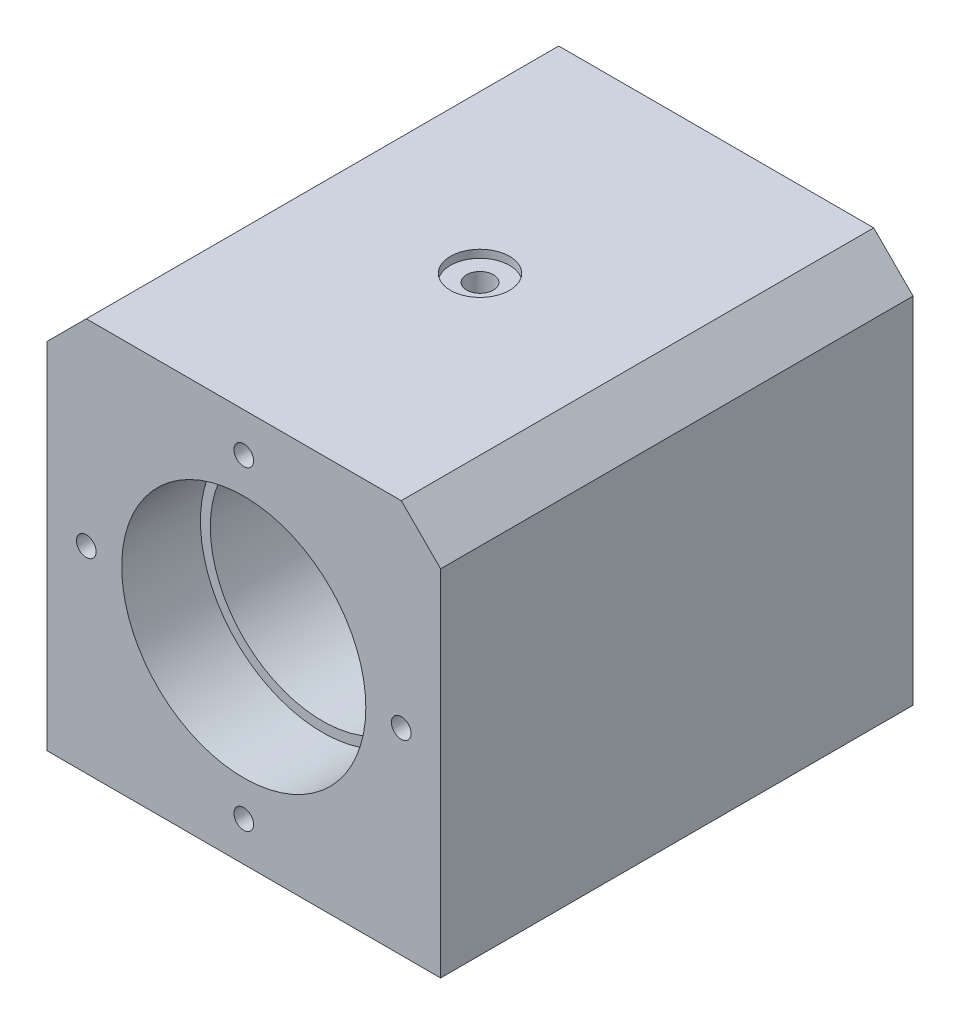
ISO-10303-21;
HEADER;
FILE_DESCRIPTION(('STEP AP214'),'2;1');
FILE_NAME('part.step','',(''),(''),'','','');
FILE_SCHEMA(('AUTOMOTIVE_DESIGN { 1 0 10303 214 1 1 1 1 }'));
ENDSEC;
DATA;
#1=APPLICATION_CONTEXT('core data for automotive mechanical design processes');
#2=APPLICATION_PROTOCOL_DEFINITION('international standard','automotive_design',2000,#1);
#3=PRODUCT_CONTEXT('',#1,'mechanical');
#4=PRODUCT('Part','Part','',(#3));
#5=PRODUCT_RELATED_PRODUCT_CATEGORY('part','',(#4));
#6=PRODUCT_DEFINITION_FORMATION('','',#4);
#7=PRODUCT_DEFINITION_CONTEXT('part definition',#1,'design');
#8=PRODUCT_DEFINITION('design','',#6,#7);
#9=PRODUCT_DEFINITION_SHAPE('','',#8);
#10=(LENGTH_UNIT() NAMED_UNIT(*) SI_UNIT(.MILLI.,.METRE.));
#11=(NAMED_UNIT(*) PLANE_ANGLE_UNIT() SI_UNIT($,.RADIAN.));
#12=(NAMED_UNIT(*) SI_UNIT($,.STERADIAN.) SOLID_ANGLE_UNIT());
#13=UNCERTAINTY_MEASURE_WITH_UNIT(LENGTH_MEASURE(1.E-05),#10,'distance_accuracy_value','');
#14=(GEOMETRIC_REPRESENTATION_CONTEXT(3) GLOBAL_UNCERTAINTY_ASSIGNED_CONTEXT((#13)) GLOBAL_UNIT_ASSIGNED_CONTEXT((#10,
#11,#12)) REPRESENTATION_CONTEXT('',''));
#15=CARTESIAN_POINT('',(0.,0.,0.));
#16=DIRECTION('',(0.,0.,1.));
#17=DIRECTION('',(1.,0.,0.));
#18=AXIS2_PLACEMENT_3D('',#15,#16,#17);
#19=CARTESIAN_POINT('',(0.,0.,-60.));
#20=DIRECTION('',(0.,0.,1.));
#21=DIRECTION('',(1.,0.,0.));
#22=AXIS2_PLACEMENT_3D('',#19,#20,#21);
#23=PLANE('',#22);
#24=CARTESIAN_POINT('',(0.,40.,-60.));
#25=DIRECTION('',(0.,0.,-1.));
#26=DIRECTION('',(-1.,0.,0.));
#27=AXIS2_PLACEMENT_3D('',#24,#25,#26);
#28=CIRCLE('',#27,2.5);
#29=CARTESIAN_POINT('',(-2.5,40.,-60.));
#30=VERTEX_POINT('',#29);
#31=EDGE_CURVE('E167',#30,#30,#28,.T.);
#32=ORIENTED_EDGE('',*,*,#31,.F.);
#33=EDGE_LOOP('',(#32));
#34=FACE_BOUND('',#33,.T.);
#35=CARTESIAN_POINT('',(40.,0.,-60.));
#36=DIRECTION('',(0.,0.,-1.));
#37=DIRECTION('',(-1.,0.,0.));
#38=AXIS2_PLACEMENT_3D('',#35,#36,#37);
#39=CIRCLE('',#38,2.5);
#40=CARTESIAN_POINT('',(37.5,0.,-60.));
#41=VERTEX_POINT('',#40);
#42=EDGE_CURVE('E173',#41,#41,#39,.T.);
#43=ORIENTED_EDGE('',*,*,#42,.F.);
#44=EDGE_LOOP('',(#43));
#45=FACE_BOUND('',#44,.T.);
#46=CARTESIAN_POINT('',(0.,-40.,-60.));
#47=DIRECTION('',(0.,0.,-1.));
#48=DIRECTION('',(-1.,0.,0.));
#49=AXIS2_PLACEMENT_3D('',#46,#47,#48);
#50=CIRCLE('',#49,2.5);
#51=CARTESIAN_POINT('',(-2.49999999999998,-40.,-60.));
#52=VERTEX_POINT('',#51);
#53=EDGE_CURVE('E179',#52,#52,#50,.T.);
#54=ORIENTED_EDGE('',*,*,#53,.F.);
#55=EDGE_LOOP('',(#54));
#56=FACE_BOUND('',#55,.T.);
#57=CARTESIAN_POINT('',(-40.,0.,-60.));
#58=DIRECTION('',(0.,0.,-1.));
#59=DIRECTION('',(-1.,0.,0.));
#60=AXIS2_PLACEMENT_3D('',#57,#58,#59);
#61=CIRCLE('',#60,2.5);
#62=CARTESIAN_POINT('',(-42.5,0.,-60.));
#63=VERTEX_POINT('',#62);
#64=EDGE_CURVE('E185',#63,#63,#61,.T.);
#65=ORIENTED_EDGE('',*,*,#64,.F.);
#66=EDGE_LOOP('',(#65));
#67=FACE_BOUND('',#66,.T.);
#68=DIRECTION('',(-1.,0.,0.));
#69=VECTOR('',#68,1.);
#70=CARTESIAN_POINT('',(-50.,50.,-60.));
#71=LINE('',#70,#69);
#72=CARTESIAN_POINT('',(40.,50.,-60.));
#73=VERTEX_POINT('',#72);
#74=CARTESIAN_POINT('',(-40.,50.,-60.));
#75=VERTEX_POINT('',#74);
#76=EDGE_CURVE('E252',#73,#75,#71,.T.);
#77=ORIENTED_EDGE('',*,*,#76,.F.);
#78=DIRECTION('',(-0.707106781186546,0.707106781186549,0.));
#79=VECTOR('',#78,1.);
#80=CARTESIAN_POINT('',(40.,50.,-60.));
#81=LINE('',#80,#79);
#82=CARTESIAN_POINT('',(50.,40.,-60.));
#83=VERTEX_POINT('',#82);
#84=EDGE_CURVE('E270',#73,#83,#81,.F.);
#85=ORIENTED_EDGE('',*,*,#84,.T.);
#86=DIRECTION('',(0.,1.,0.));
#87=VECTOR('',#86,1.);
#88=CARTESIAN_POINT('',(50.,50.,-60.));
#89=LINE('',#88,#87);
#90=CARTESIAN_POINT('',(50.,-50.,-60.));
#91=VERTEX_POINT('',#90);
#92=EDGE_CURVE('E238',#91,#83,#89,.T.);
#93=ORIENTED_EDGE('',*,*,#92,.F.);
#94=DIRECTION('',(1.,0.,0.));
#95=VECTOR('',#94,1.);
#96=CARTESIAN_POINT('',(-50.,-50.,-60.));
#97=LINE('',#96,#95);
#98=CARTESIAN_POINT('',(-50.,-50.,-60.));
#99=VERTEX_POINT('',#98);
#100=EDGE_CURVE('E244',#99,#91,#97,.T.);
#101=ORIENTED_EDGE('',*,*,#100,.F.);
#102=DIRECTION('',(0.,-1.,0.));
#103=VECTOR('',#102,1.);
#104=CARTESIAN_POINT('',(-50.,50.,-60.));
#105=LINE('',#104,#103);
#106=CARTESIAN_POINT('',(-50.,40.,-60.));
#107=VERTEX_POINT('',#106);
#108=EDGE_CURVE('E255',#107,#99,#105,.T.);
#109=ORIENTED_EDGE('',*,*,#108,.F.);
#110=DIRECTION('',(-0.70710678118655,-0.707106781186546,0.));
#111=VECTOR('',#110,1.);
#112=CARTESIAN_POINT('',(-50.,40.,-60.));
#113=LINE('',#112,#111);
#114=EDGE_CURVE('E268',#107,#75,#113,.F.);
#115=ORIENTED_EDGE('',*,*,#114,.T.);
#116=EDGE_LOOP('',(#77,#85,#93,#101,#109,#115));
#117=FACE_BOUND('',#116,.T.);
#118=CARTESIAN_POINT('',(0.,0.,-60.));
#119=DIRECTION('',(0.,0.,1.));
#120=DIRECTION('',(1.,0.,0.));
#121=AXIS2_PLACEMENT_3D('',#118,#119,#120);
#122=CIRCLE('',#121,31.);
#123=CARTESIAN_POINT('',(31.,0.,-60.));
#124=VERTEX_POINT('',#123);
#125=EDGE_CURVE('E221',#124,#124,#122,.T.);
#126=ORIENTED_EDGE('',*,*,#125,.T.);
#127=EDGE_LOOP('',(#126));
#128=FACE_BOUND('',#127,.T.);
#129=ADVANCED_FACE('F38',(#34,#45,#56,#67,#117,#128),#23,.F.);
#130=CARTESIAN_POINT('',(50.,50.,60.));
#131=DIRECTION('',(-1.,0.,0.));
#132=DIRECTION('',(0.,0.,1.));
#133=AXIS2_PLACEMENT_3D('',#130,#131,#132);
#134=PLANE('',#133);
#135=ORIENTED_EDGE('',*,*,#92,.T.);
#136=DIRECTION('',(0.,0.,1.));
#137=VECTOR('',#136,1.);
#138=CARTESIAN_POINT('',(50.,40.,60.));
#139=LINE('',#138,#137);
#140=CARTESIAN_POINT('',(50.,40.,60.));
#141=VERTEX_POINT('',#140);
#142=EDGE_CURVE('E67',#83,#141,#139,.T.);
#143=ORIENTED_EDGE('',*,*,#142,.T.);
#144=DIRECTION('',(0.,1.,0.));
#145=VECTOR('',#144,1.);
#146=CARTESIAN_POINT('',(50.,50.,60.));
#147=LINE('',#146,#145);
#148=CARTESIAN_POINT('',(50.,-50.,60.));
#149=VERTEX_POINT('',#148);
#150=EDGE_CURVE('E241',#149,#141,#147,.T.);
#151=ORIENTED_EDGE('',*,*,#150,.F.);
#152=DIRECTION('',(0.,0.,-1.));
#153=VECTOR('',#152,1.);
#154=CARTESIAN_POINT('',(50.,-50.,60.));
#155=LINE('',#154,#153);
#156=EDGE_CURVE('E250',#149,#91,#155,.T.);
#157=ORIENTED_EDGE('',*,*,#156,.T.);
#158=EDGE_LOOP('',(#135,#143,#151,#157));
#159=FACE_BOUND('',#158,.T.);
#160=ADVANCED_FACE('F297',(#159),#134,.F.);
#161=CARTESIAN_POINT('',(-50.,50.,60.));
#162=DIRECTION('',(0.,-1.,0.));
#163=DIRECTION('',(0.,0.,-1.));
#164=AXIS2_PLACEMENT_3D('',#161,#162,#163);
#165=PLANE('',#164);
#166=CARTESIAN_POINT('',(0.,50.,0.));
#167=DIRECTION('',(0.,1.,0.));
#168=DIRECTION('',(0.,0.,1.));
#169=AXIS2_PLACEMENT_3D('',#166,#167,#168);
#170=CIRCLE('',#169,7.5);
#171=CARTESIAN_POINT('',(0.,50.,7.5));
#172=VERTEX_POINT('',#171);
#173=EDGE_CURVE('E232',#172,#172,#170,.T.);
#174=ORIENTED_EDGE('',*,*,#173,.F.);
#175=EDGE_LOOP('',(#174));
#176=FACE_BOUND('',#175,.T.);
#177=DIRECTION('',(-1.,0.,0.));
#178=VECTOR('',#177,1.);
#179=CARTESIAN_POINT('',(-50.,50.,60.));
#180=LINE('',#179,#178);
#181=CARTESIAN_POINT('',(40.,50.,60.));
#182=VERTEX_POINT('',#181);
#183=CARTESIAN_POINT('',(-40.,50.,60.));
#184=VERTEX_POINT('',#183);
#185=EDGE_CURVE('E243',#182,#184,#180,.T.);
#186=ORIENTED_EDGE('',*,*,#185,.F.);
#187=DIRECTION('',(0.,0.,-1.));
#188=VECTOR('',#187,1.);
#189=CARTESIAN_POINT('',(40.,50.,60.));
#190=LINE('',#189,#188);
#191=EDGE_CURVE('E265',#182,#73,#190,.T.);
#192=ORIENTED_EDGE('',*,*,#191,.T.);
#193=ORIENTED_EDGE('',*,*,#76,.T.);
#194=DIRECTION('',(0.,0.,1.));
#195=VECTOR('',#194,1.);
#196=CARTESIAN_POINT('',(-40.,50.,60.));
#197=LINE('',#196,#195);
#198=EDGE_CURVE('E263',#75,#184,#197,.T.);
#199=ORIENTED_EDGE('',*,*,#198,.T.);
#200=EDGE_LOOP('',(#186,#192,#193,#199));
#201=FACE_BOUND('',#200,.T.);
#202=ADVANCED_FACE('F303',(#176,#201),#165,.F.);
#203=CARTESIAN_POINT('',(-50.,50.,60.));
#204=DIRECTION('',(1.,0.,0.));
#205=DIRECTION('',(0.,1.,0.));
#206=AXIS2_PLACEMENT_3D('',#203,#204,#205);
#207=PLANE('',#206);
#208=DIRECTION('',(0.,-1.,0.));
#209=VECTOR('',#208,1.);
#210=CARTESIAN_POINT('',(-50.,50.,60.));
#211=LINE('',#210,#209);
#212=CARTESIAN_POINT('',(-50.,40.,60.));
#213=VERTEX_POINT('',#212);
#214=CARTESIAN_POINT('',(-50.,-50.,60.));
#215=VERTEX_POINT('',#214);
#216=EDGE_CURVE('E246',#213,#215,#211,.T.);
#217=ORIENTED_EDGE('',*,*,#216,.F.);
#218=DIRECTION('',(0.,0.,-1.));
#219=VECTOR('',#218,1.);
#220=CARTESIAN_POINT('',(-50.,40.,60.));
#221=LINE('',#220,#219);
#222=EDGE_CURVE('E11',#213,#107,#221,.T.);
#223=ORIENTED_EDGE('',*,*,#222,.T.);
#224=ORIENTED_EDGE('',*,*,#108,.T.);
#225=DIRECTION('',(0.,0.,-1.));
#226=VECTOR('',#225,1.);
#227=CARTESIAN_POINT('',(-50.,-50.,60.));
#228=LINE('',#227,#226);
#229=EDGE_CURVE('E260',#215,#99,#228,.T.);
#230=ORIENTED_EDGE('',*,*,#229,.F.);
#231=EDGE_LOOP('',(#217,#223,#224,#230));
#232=FACE_BOUND('',#231,.T.);
#233=ADVANCED_FACE('F314',(#232),#207,.F.);
#234=CARTESIAN_POINT('',(-50.,-50.,60.));
#235=DIRECTION('',(0.,1.,0.));
#236=DIRECTION('',(0.,0.,1.));
#237=AXIS2_PLACEMENT_3D('',#234,#235,#236);
#238=PLANE('',#237);
#239=CARTESIAN_POINT('',(-18.,-50.,40.));
#240=DIRECTION('',(0.,-1.,0.));
#241=DIRECTION('',(0.,0.,-1.));
#242=AXIS2_PLACEMENT_3D('',#239,#240,#241);
#243=CIRCLE('',#242,3.4);
#244=CARTESIAN_POINT('',(-18.,-50.,36.6));
#245=VERTEX_POINT('',#244);
#246=EDGE_CURVE('E145',#245,#245,#243,.T.);
#247=ORIENTED_EDGE('',*,*,#246,.F.);
#248=EDGE_LOOP('',(#247));
#249=FACE_BOUND('',#248,.T.);
#250=CARTESIAN_POINT('',(18.,-50.,40.));
#251=DIRECTION('',(0.,-1.,0.));
#252=DIRECTION('',(0.,0.,-1.));
#253=AXIS2_PLACEMENT_3D('',#250,#251,#252);
#254=CIRCLE('',#253,3.4);
#255=CARTESIAN_POINT('',(18.,-50.,36.6));
#256=VERTEX_POINT('',#255);
#257=EDGE_CURVE('E144',#256,#256,#254,.T.);
#258=ORIENTED_EDGE('',*,*,#257,.F.);
#259=EDGE_LOOP('',(#258));
#260=FACE_BOUND('',#259,.T.);
#261=CARTESIAN_POINT('',(-30.,-50.,40.));
#262=DIRECTION('',(0.,-1.,0.));
#263=DIRECTION('',(0.,0.,-1.));
#264=AXIS2_PLACEMENT_3D('',#261,#262,#263);
#265=CIRCLE('',#264,2.99999999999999);
#266=CARTESIAN_POINT('',(-30.,-50.,37.));
#267=VERTEX_POINT('',#266);
#268=EDGE_CURVE('E155',#267,#267,#265,.T.);
#269=ORIENTED_EDGE('',*,*,#268,.F.);
#270=EDGE_LOOP('',(#269));
#271=FACE_BOUND('',#270,.T.);
#272=CARTESIAN_POINT('',(30.,-50.,40.));
#273=DIRECTION('',(0.,-1.,0.));
#274=DIRECTION('',(0.,0.,-1.));
#275=AXIS2_PLACEMENT_3D('',#272,#273,#274);
#276=CIRCLE('',#275,2.99999999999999);
#277=CARTESIAN_POINT('',(30.,-50.,37.));
#278=VERTEX_POINT('',#277);
#279=EDGE_CURVE('E161',#278,#278,#276,.T.);
#280=ORIENTED_EDGE('',*,*,#279,.F.);
#281=EDGE_LOOP('',(#280));
#282=FACE_BOUND('',#281,.T.);
#283=ORIENTED_EDGE('',*,*,#100,.T.);
#284=ORIENTED_EDGE('',*,*,#156,.F.);
#285=DIRECTION('',(1.,0.,0.));
#286=VECTOR('',#285,1.);
#287=CARTESIAN_POINT('',(-50.,-50.,60.));
#288=LINE('',#287,#286);
#289=EDGE_CURVE('E248',#215,#149,#288,.T.);
#290=ORIENTED_EDGE('',*,*,#289,.F.);
#291=ORIENTED_EDGE('',*,*,#229,.T.);
#292=EDGE_LOOP('',(#283,#284,#290,#291));
#293=FACE_BOUND('',#292,.T.);
#294=ADVANCED_FACE('F311',(#249,#260,#271,#282,#293),#238,.F.);
#295=CARTESIAN_POINT('',(0.,0.,60.));
#296=DIRECTION('',(0.,0.,1.));
#297=DIRECTION('',(1.,0.,0.));
#298=AXIS2_PLACEMENT_3D('',#295,#296,#297);
#299=PLANE('',#298);
#300=CARTESIAN_POINT('',(0.,40.,60.));
#301=DIRECTION('',(0.,0.,1.));
#302=DIRECTION('',(1.,0.,0.));
#303=AXIS2_PLACEMENT_3D('',#300,#301,#302);
#304=CIRCLE('',#303,2.5);
#305=CARTESIAN_POINT('',(2.5,40.,60.));
#306=VERTEX_POINT('',#305);
#307=EDGE_CURVE('E191',#306,#306,#304,.T.);
#308=ORIENTED_EDGE('',*,*,#307,.F.);
#309=EDGE_LOOP('',(#308));
#310=FACE_BOUND('',#309,.T.);
#311=CARTESIAN_POINT('',(40.,0.,60.));
#312=DIRECTION('',(0.,0.,1.));
#313=DIRECTION('',(1.,0.,0.));
#314=AXIS2_PLACEMENT_3D('',#311,#312,#313);
#315=CIRCLE('',#314,2.5);
#316=CARTESIAN_POINT('',(42.5,0.,60.));
#317=VERTEX_POINT('',#316);
#318=EDGE_CURVE('E197',#317,#317,#315,.T.);
#319=ORIENTED_EDGE('',*,*,#318,.F.);
#320=EDGE_LOOP('',(#319));
#321=FACE_BOUND('',#320,.T.);
#322=CARTESIAN_POINT('',(0.,-40.,60.));
#323=DIRECTION('',(0.,0.,1.));
#324=DIRECTION('',(1.,0.,0.));
#325=AXIS2_PLACEMENT_3D('',#322,#323,#324);
#326=CIRCLE('',#325,2.5);
#327=CARTESIAN_POINT('',(2.50000000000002,-40.,60.));
#328=VERTEX_POINT('',#327);
#329=EDGE_CURVE('E203',#328,#328,#326,.T.);
#330=ORIENTED_EDGE('',*,*,#329,.F.);
#331=EDGE_LOOP('',(#330));
#332=FACE_BOUND('',#331,.T.);
#333=CARTESIAN_POINT('',(-40.,0.,60.));
#334=DIRECTION('',(0.,0.,1.));
#335=DIRECTION('',(1.,0.,0.));
#336=AXIS2_PLACEMENT_3D('',#333,#334,#335);
#337=CIRCLE('',#336,2.5);
#338=CARTESIAN_POINT('',(-37.5,0.,60.));
#339=VERTEX_POINT('',#338);
#340=EDGE_CURVE('E209',#339,#339,#337,.T.);
#341=ORIENTED_EDGE('',*,*,#340,.F.);
#342=EDGE_LOOP('',(#341));
#343=FACE_BOUND('',#342,.T.);
#344=CARTESIAN_POINT('',(0.,0.,60.));
#345=DIRECTION('',(0.,0.,1.));
#346=DIRECTION('',(1.,0.,0.));
#347=AXIS2_PLACEMENT_3D('',#344,#345,#346);
#348=CIRCLE('',#347,31.);
#349=CARTESIAN_POINT('',(31.,0.,60.));
#350=VERTEX_POINT('',#349);
#351=EDGE_CURVE('E226',#350,#350,#348,.T.);
#352=ORIENTED_EDGE('',*,*,#351,.F.);
#353=EDGE_LOOP('',(#352));
#354=FACE_BOUND('',#353,.T.);
#355=ORIENTED_EDGE('',*,*,#150,.T.);
#356=DIRECTION('',(0.707106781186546,-0.707106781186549,0.));
#357=VECTOR('',#356,1.);
#358=CARTESIAN_POINT('',(45.0000000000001,44.9999999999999,60.));
#359=LINE('',#358,#357);
#360=EDGE_CURVE('E51',#141,#182,#359,.F.);
#361=ORIENTED_EDGE('',*,*,#360,.T.);
#362=ORIENTED_EDGE('',*,*,#185,.T.);
#363=DIRECTION('',(0.70710678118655,0.707106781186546,0.));
#364=VECTOR('',#363,1.);
#365=CARTESIAN_POINT('',(-44.9999999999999,45.0000000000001,60.));
#366=LINE('',#365,#364);
#367=EDGE_CURVE('E59',#184,#213,#366,.F.);
#368=ORIENTED_EDGE('',*,*,#367,.T.);
#369=ORIENTED_EDGE('',*,*,#216,.T.);
#370=ORIENTED_EDGE('',*,*,#289,.T.);
#371=EDGE_LOOP('',(#355,#361,#362,#368,#369,#370));
#372=FACE_BOUND('',#371,.T.);
#373=ADVANCED_FACE('F309',(#310,#321,#332,#343,#354,#372),#299,.T.);
#374=CARTESIAN_POINT('',(40.,50.,60.));
#375=DIRECTION('',(-0.707106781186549,-0.707106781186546,0.));
#376=DIRECTION('',(0.,0.,-1.));
#377=AXIS2_PLACEMENT_3D('',#374,#375,#376);
#378=PLANE('',#377);
#379=ORIENTED_EDGE('',*,*,#360,.F.);
#380=ORIENTED_EDGE('',*,*,#142,.F.);
#381=ORIENTED_EDGE('',*,*,#84,.F.);
#382=ORIENTED_EDGE('',*,*,#191,.F.);
#383=EDGE_LOOP('',(#379,#380,#381,#382));
#384=FACE_BOUND('',#383,.T.);
#385=ADVANCED_FACE('F321',(#384),#378,.F.);
#386=CARTESIAN_POINT('',(-50.,40.,60.));
#387=DIRECTION('',(0.707106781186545,-0.707106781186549,0.));
#388=DIRECTION('',(0.,0.,-1.));
#389=AXIS2_PLACEMENT_3D('',#386,#387,#388);
#390=PLANE('',#389);
#391=ORIENTED_EDGE('',*,*,#367,.F.);
#392=ORIENTED_EDGE('',*,*,#198,.F.);
#393=ORIENTED_EDGE('',*,*,#114,.F.);
#394=ORIENTED_EDGE('',*,*,#222,.F.);
#395=EDGE_LOOP('',(#391,#392,#393,#394));
#396=FACE_BOUND('',#395,.T.);
#397=ADVANCED_FACE('F40',(#396),#390,.F.);
#398=CARTESIAN_POINT('',(0.,48.,0.));
#399=DIRECTION('',(0.,1.,0.));
#400=DIRECTION('',(0.,0.,1.));
#401=AXIS2_PLACEMENT_3D('',#398,#399,#400);
#402=CYLINDRICAL_SURFACE('',#401,7.5);
#403=CARTESIAN_POINT('',(0.,48.,0.));
#404=DIRECTION('',(0.,1.,0.));
#405=DIRECTION('',(0.,0.,1.));
#406=AXIS2_PLACEMENT_3D('',#403,#404,#405);
#407=CIRCLE('',#406,7.5);
#408=CARTESIAN_POINT('',(0.,48.,7.5));
#409=VERTEX_POINT('',#408);
#410=EDGE_CURVE('E235',#409,#409,#407,.T.);
#411=ORIENTED_EDGE('',*,*,#410,.F.);
#412=EDGE_LOOP('',(#411));
#413=FACE_BOUND('',#412,.T.);
#414=ORIENTED_EDGE('',*,*,#173,.T.);
#415=EDGE_LOOP('',(#414));
#416=FACE_BOUND('',#415,.T.);
#417=ADVANCED_FACE('F328',(#413,#416),#402,.F.);
#418=CARTESIAN_POINT('',(0.,48.,0.));
#419=DIRECTION('',(0.,1.,0.));
#420=DIRECTION('',(0.,0.,1.));
#421=AXIS2_PLACEMENT_3D('',#418,#419,#420);
#422=PLANE('',#421);
#423=CARTESIAN_POINT('',(0.,48.,0.));
#424=DIRECTION('',(0.,1.,0.));
#425=DIRECTION('',(0.,0.,1.));
#426=AXIS2_PLACEMENT_3D('',#423,#424,#425);
#427=CIRCLE('',#426,3.39999999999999);
#428=CARTESIAN_POINT('',(0.,48.,3.39999999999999));
#429=VERTEX_POINT('',#428);
#430=EDGE_CURVE('E215',#429,#429,#427,.T.);
#431=ORIENTED_EDGE('',*,*,#430,.F.);
#432=EDGE_LOOP('',(#431));
#433=FACE_BOUND('',#432,.T.);
#434=ORIENTED_EDGE('',*,*,#410,.T.);
#435=EDGE_LOOP('',(#434));
#436=FACE_BOUND('',#435,.T.);
#437=ADVANCED_FACE('F366',(#433,#436),#422,.T.);
#438=CARTESIAN_POINT('',(0.,0.,40.));
#439=DIRECTION('',(0.,0.,1.));
#440=DIRECTION('',(1.,0.,0.));
#441=AXIS2_PLACEMENT_3D('',#438,#439,#440);
#442=CYLINDRICAL_SURFACE('',#441,31.);
#443=CARTESIAN_POINT('',(0.,0.,40.));
#444=DIRECTION('',(0.,0.,1.));
#445=DIRECTION('',(1.,0.,0.));
#446=AXIS2_PLACEMENT_3D('',#443,#444,#445);
#447=CIRCLE('',#446,31.);
#448=CARTESIAN_POINT('',(31.,0.,40.));
#449=VERTEX_POINT('',#448);
#450=EDGE_CURVE('E229',#449,#449,#447,.T.);
#451=ORIENTED_EDGE('',*,*,#450,.F.);
#452=EDGE_LOOP('',(#451));
#453=FACE_BOUND('',#452,.T.);
#454=ORIENTED_EDGE('',*,*,#351,.T.);
#455=EDGE_LOOP('',(#454));
#456=FACE_BOUND('',#455,.T.);
#457=ADVANCED_FACE('F360',(#453,#456),#442,.F.);
#458=CARTESIAN_POINT('',(0.,0.,40.));
#459=DIRECTION('',(0.,0.,1.));
#460=DIRECTION('',(1.,0.,0.));
#461=AXIS2_PLACEMENT_3D('',#458,#459,#460);
#462=PLANE('',#461);
#463=CARTESIAN_POINT('',(0.,0.,40.));
#464=DIRECTION('',(0.,0.,1.));
#465=DIRECTION('',(1.,0.,0.));
#466=AXIS2_PLACEMENT_3D('',#463,#464,#465);
#467=CIRCLE('',#466,28.5);
#468=CARTESIAN_POINT('',(28.5,0.,40.));
#469=VERTEX_POINT('',#468);
#470=EDGE_CURVE('E218',#469,#469,#467,.T.);
#471=ORIENTED_EDGE('',*,*,#470,.F.);
#472=EDGE_LOOP('',(#471));
#473=FACE_BOUND('',#472,.T.);
#474=ORIENTED_EDGE('',*,*,#450,.T.);
#475=EDGE_LOOP('',(#474));
#476=FACE_BOUND('',#475,.T.);
#477=ADVANCED_FACE('F351',(#473,#476),#462,.T.);
#478=CARTESIAN_POINT('',(0.,0.,-40.));
#479=DIRECTION('',(0.,0.,-1.));
#480=DIRECTION('',(-1.,0.,0.));
#481=AXIS2_PLACEMENT_3D('',#478,#479,#480);
#482=CYLINDRICAL_SURFACE('',#481,31.);
#483=CARTESIAN_POINT('',(0.,0.,-40.));
#484=DIRECTION('',(0.,0.,1.));
#485=DIRECTION('',(1.,0.,0.));
#486=AXIS2_PLACEMENT_3D('',#483,#484,#485);
#487=CIRCLE('',#486,31.);
#488=CARTESIAN_POINT('',(31.,0.,-40.));
#489=VERTEX_POINT('',#488);
#490=EDGE_CURVE('E223',#489,#489,#487,.T.);
#491=ORIENTED_EDGE('',*,*,#490,.T.);
#492=EDGE_LOOP('',(#491));
#493=FACE_BOUND('',#492,.T.);
#494=ORIENTED_EDGE('',*,*,#125,.F.);
#495=EDGE_LOOP('',(#494));
#496=FACE_BOUND('',#495,.T.);
#497=ADVANCED_FACE('F349',(#493,#496),#482,.F.);
#498=CARTESIAN_POINT('',(0.,0.,-40.));
#499=DIRECTION('',(0.,0.,-1.));
#500=DIRECTION('',(1.,0.,0.));
#501=AXIS2_PLACEMENT_3D('',#498,#499,#500);
#502=PLANE('',#501);
#503=CARTESIAN_POINT('',(0.,0.,-40.));
#504=DIRECTION('',(0.,0.,-1.));
#505=DIRECTION('',(-1.,0.,0.));
#506=AXIS2_PLACEMENT_3D('',#503,#504,#505);
#507=CIRCLE('',#506,28.5);
#508=CARTESIAN_POINT('',(-28.5,0.,-40.));
#509=VERTEX_POINT('',#508);
#510=EDGE_CURVE('E222',#509,#509,#507,.T.);
#511=ORIENTED_EDGE('',*,*,#510,.F.);
#512=EDGE_LOOP('',(#511));
#513=FACE_BOUND('',#512,.T.);
#514=ORIENTED_EDGE('',*,*,#490,.F.);
#515=EDGE_LOOP('',(#514));
#516=FACE_BOUND('',#515,.T.);
#517=ADVANCED_FACE('F294',(#513,#516),#502,.T.);
#518=CARTESIAN_POINT('',(0.,0.,-60.));
#519=DIRECTION('',(0.,0.,1.));
#520=DIRECTION('',(1.,0.,0.));
#521=AXIS2_PLACEMENT_3D('',#518,#519,#520);
#522=CYLINDRICAL_SURFACE('',#521,28.5);
#523=CARTESIAN_POINT('',(0.,28.5,3.39999999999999));
#524=CARTESIAN_POINT('',(0.190254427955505,28.4999974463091,3.39999187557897));
#525=CARTESIAN_POINT('',(0.380629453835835,28.4980747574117,3.38397702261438));
#526=CARTESIAN_POINT('',(0.756086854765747,28.4905896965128,3.32034070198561));
#527=CARTESIAN_POINT('',(0.941163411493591,28.4850234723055,3.27268578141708));
#528=CARTESIAN_POINT('',(1.30053362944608,28.47087871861,3.14718917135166));
#529=CARTESIAN_POINT('',(1.47483427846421,28.4623021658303,3.06936728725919));
#530=CARTESIAN_POINT('',(1.80786668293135,28.4430919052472,2.88578799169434));
#531=CARTESIAN_POINT('',(1.96660120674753,28.4324585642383,2.78003555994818));
#532=CARTESIAN_POINT('',(2.26482899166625,28.4102630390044,2.54302739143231));
#533=CARTESIAN_POINT('',(2.404232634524,28.3986968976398,2.41165924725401));
#534=CARTESIAN_POINT('',(2.65907002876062,28.3759714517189,2.12738978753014));
#535=CARTESIAN_POINT('',(2.77450258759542,28.3648121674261,1.97448740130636));
#536=CARTESIAN_POINT('',(2.97845129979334,28.3441247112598,1.65091214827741));
#537=CARTESIAN_POINT('',(3.06688413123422,28.3346016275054,1.48018641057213));
#538=CARTESIAN_POINT('',(3.21379102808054,28.3183163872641,1.12617495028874));
#539=CARTESIAN_POINT('',(3.27226613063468,28.3115541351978,0.942889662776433));
#540=CARTESIAN_POINT('',(3.3573268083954,28.301593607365,0.569888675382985));
#541=CARTESIAN_POINT('',(3.38406314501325,28.2983784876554,0.380207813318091));
#542=CARTESIAN_POINT('',(3.40535373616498,28.2958245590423,-0.00097383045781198));
#543=CARTESIAN_POINT('',(3.39990917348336,28.2964856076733,-0.192474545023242));
#544=CARTESIAN_POINT('',(3.35711639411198,28.3015939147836,-0.570812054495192));
#545=CARTESIAN_POINT('',(3.31993388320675,28.3060215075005,-0.757667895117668));
#546=CARTESIAN_POINT('',(3.21497904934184,28.3181333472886,-1.12246852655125));
#547=CARTESIAN_POINT('',(3.14720615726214,28.3258176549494,-1.30041315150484));
#548=CARTESIAN_POINT('',(2.98281509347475,28.3435994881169,-1.64285708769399));
#549=CARTESIAN_POINT('',(2.88612454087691,28.3537030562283,-1.80732132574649));
#550=CARTESIAN_POINT('',(2.66669467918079,28.375180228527,-2.11775175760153));
#551=CARTESIAN_POINT('',(2.54395428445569,28.386553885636,-2.26371718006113));
#552=CARTESIAN_POINT('',(2.27498876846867,28.4093772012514,-2.53396864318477));
#553=CARTESIAN_POINT('',(2.12862074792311,28.4208268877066,-2.65811250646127));
#554=CARTESIAN_POINT('',(1.81704787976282,28.4424450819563,-2.88009109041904));
#555=CARTESIAN_POINT('',(1.65184299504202,28.452613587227,-2.97792575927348));
#556=CARTESIAN_POINT('',(1.30717906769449,28.4705292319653,-3.14450745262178));
#557=CARTESIAN_POINT('',(1.12771588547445,28.4782756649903,-3.21324599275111));
#558=CARTESIAN_POINT('',(0.75968173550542,28.4904677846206,-3.31957347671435));
#559=CARTESIAN_POINT('',(0.571111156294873,28.4949136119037,-3.35716374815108));
#560=CARTESIAN_POINT('',(0.191444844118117,28.4999853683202,-3.39994433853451));
#561=CARTESIAN_POINT('',(0.000371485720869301,28.500634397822,-3.4053305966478));
#562=CARTESIAN_POINT('',(-0.379955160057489,28.4981016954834,-3.38406674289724));
#563=CARTESIAN_POINT('',(-0.569208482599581,28.4949200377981,-3.35741725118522));
#564=CARTESIAN_POINT('',(-0.939947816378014,28.4850979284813,-3.27300110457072));
#565=CARTESIAN_POINT('',(-1.12145530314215,28.4784678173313,-3.21532746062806));
#566=CARTESIAN_POINT('',(-1.47222143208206,28.4624914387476,-3.07059657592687));
#567=CARTESIAN_POINT('',(-1.6414796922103,28.4531450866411,-2.98353841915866));
#568=CARTESIAN_POINT('',(-1.96382051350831,28.4327214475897,-2.78203277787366));
#569=CARTESIAN_POINT('',(-2.1168230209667,28.4216362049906,-2.66745805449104));
#570=CARTESIAN_POINT('',(-2.40149570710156,28.3990008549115,-2.4143522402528));
#571=CARTESIAN_POINT('',(-2.53316511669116,28.3874507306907,-2.27582028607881));
#572=CARTESIAN_POINT('',(-2.77212552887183,28.3651165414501,-1.97787130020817));
#573=CARTESIAN_POINT('',(-2.87928696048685,28.3543367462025,-1.81834998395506));
#574=CARTESIAN_POINT('',(-3.06529546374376,28.3348327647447,-1.48345858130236));
#575=CARTESIAN_POINT('',(-3.14414305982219,28.3261085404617,-1.30808878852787));
#576=CARTESIAN_POINT('',(-3.27107414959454,28.3117320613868,-0.946903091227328));
#577=CARTESIAN_POINT('',(-3.3192316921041,28.3060724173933,-0.76111351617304));
#578=CARTESIAN_POINT('',(-3.3836545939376,28.2984443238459,-0.384013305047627));
#579=CARTESIAN_POINT('',(-3.39992129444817,28.2964757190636,-0.192702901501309));
#580=CARTESIAN_POINT('',(-3.40007764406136,28.2964568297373,0.188719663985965));
#581=CARTESIAN_POINT('',(-3.38417084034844,28.2983819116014,0.378831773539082));
#582=CARTESIAN_POINT('',(-3.32086170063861,28.3058806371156,0.753660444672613));
#583=CARTESIAN_POINT('',(-3.27345935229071,28.3114542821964,0.938377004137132));
#584=CARTESIAN_POINT('',(-3.148566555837,28.3256147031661,1.29715050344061));
#585=CARTESIAN_POINT('',(-3.071084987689,28.3342005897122,1.47121057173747));
#586=CARTESIAN_POINT('',(-2.88825330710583,28.3534196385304,1.8038905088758));
#587=CARTESIAN_POINT('',(-2.78290296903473,28.3640528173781,1.96251025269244));
#588=CARTESIAN_POINT('',(-2.54656636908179,28.3862490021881,2.26084835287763));
#589=CARTESIAN_POINT('',(-2.41542831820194,28.3978172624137,2.40044608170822));
#590=CARTESIAN_POINT('',(-2.13155296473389,28.4205333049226,2.6557344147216));
#591=CARTESIAN_POINT('',(-1.97881055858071,28.431680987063,2.77141935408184));
#592=CARTESIAN_POINT('',(-1.65545862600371,28.4523421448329,2.97593551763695));
#593=CARTESIAN_POINT('',(-1.48478884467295,28.4618498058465,3.06467200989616));
#594=CARTESIAN_POINT('',(-1.13095580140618,28.4780999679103,3.21210105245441));
#595=CARTESIAN_POINT('',(-0.947806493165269,28.4848455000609,3.27082655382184));
#596=CARTESIAN_POINT('',(-0.636405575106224,28.4931681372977,3.34236357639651));
#597=CARTESIAN_POINT('',(-0.510124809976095,28.4957177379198,3.36394655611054));
#598=CARTESIAN_POINT('',(-0.255914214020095,28.499134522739,3.3927674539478));
#599=CARTESIAN_POINT('',(-0.127984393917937,28.5000017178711,3.40000546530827));
#600=CARTESIAN_POINT('',(0.,28.5,3.39999999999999));
#601=B_SPLINE_CURVE_WITH_KNOTS('',3,(#523,#524,#525,#526,#527,#528,#529,#530,#531,#532,#533,
#534,#535,#536,#537,#538,#539,#540,#541,#542,#543,#544,#545,#546,#547,#548,#549,#550,#551,#552,
#553,#554,#555,#556,#557,#558,#559,#560,#561,#562,#563,#564,#565,#566,#567,#568,#569,#570,#571,
#572,#573,#574,#575,#576,#577,#578,#579,#580,#581,#582,#583,#584,#585,#586,#587,#588,#589,#590,
#591,#592,#593,#594,#595,#596,#597,#598,#599,#600),.UNSPECIFIED.,.T.,.F.,(4,2,2,2,2,2,2,2,2,2,2,
2,2,2,2,2,2,2,2,2,2,2,2,2,2,2,2,2,2,2,2,2,2,2,2,2,2,2,4),(0.,0.570295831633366,1.14119559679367,
1.71172118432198,2.28214512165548,2.85513094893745,3.42814527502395,4.00291047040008,
4.57765576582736,5.14965991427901,5.72164303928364,6.29065794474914,6.85968343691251,
7.43014529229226,8.00063092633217,8.57470586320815,9.14878193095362,9.72302528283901,
10.2972441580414,10.8679657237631,11.4386762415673,12.0076852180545,12.5767119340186,
13.1484223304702,13.720153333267,14.2948405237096,14.8695170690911,15.4428017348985,
16.0160622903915,16.5857074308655,17.1553527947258,17.7248301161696,18.2943120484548,
18.8672521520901,19.440327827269,20.0153953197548,20.5898300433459,20.9734712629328,
21.3571099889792),.UNSPECIFIED.);
#602=CARTESIAN_POINT('',(0.,28.5,3.39999999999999));
#603=VERTEX_POINT('',#602);
#604=EDGE_CURVE('E42',#603,#603,#601,.T.);
#605=ORIENTED_EDGE('',*,*,#604,.T.);
#606=EDGE_LOOP('',(#605));
#607=FACE_BOUND('',#606,.T.);
#608=ORIENTED_EDGE('',*,*,#470,.T.);
#609=EDGE_LOOP('',(#608));
#610=FACE_BOUND('',#609,.T.);
#611=ORIENTED_EDGE('',*,*,#510,.T.);
#612=EDGE_LOOP('',(#611));
#613=FACE_BOUND('',#612,.T.);
#614=ADVANCED_FACE('F280',(#607,#610,#613),#522,.F.);
#615=CARTESIAN_POINT('',(0.,48.,0.));
#616=DIRECTION('',(0.,1.,0.));
#617=DIRECTION('',(0.,0.,1.));
#618=AXIS2_PLACEMENT_3D('',#615,#616,#617);
#619=CYLINDRICAL_SURFACE('',#618,3.39999999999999);
#620=ORIENTED_EDGE('',*,*,#430,.T.);
#621=EDGE_LOOP('',(#620));
#622=FACE_BOUND('',#621,.T.);
#623=ORIENTED_EDGE('',*,*,#604,.F.);
#624=EDGE_LOOP('',(#623));
#625=FACE_BOUND('',#624,.T.);
#626=ADVANCED_FACE('F283',(#622,#625),#619,.F.);
#627=CARTESIAN_POINT('',(-40.,0.,40.));
#628=DIRECTION('',(0.,0.,1.));
#629=DIRECTION('',(1.,0.,0.));
#630=AXIS2_PLACEMENT_3D('',#627,#628,#629);
#631=CONICAL_SURFACE('',#630,2.5,1.02974425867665);
#632=CARTESIAN_POINT('',(-40.,0.,38.4978484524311));
#633=VERTEX_POINT('',#632);
#634=VERTEX_LOOP('',#633);
#635=FACE_BOUND('',#634,.T.);
#636=CARTESIAN_POINT('',(-40.,0.,40.));
#637=DIRECTION('',(0.,0.,1.));
#638=DIRECTION('',(1.,0.,0.));
#639=AXIS2_PLACEMENT_3D('',#636,#637,#638);
#640=CIRCLE('',#639,2.5);
#641=CARTESIAN_POINT('',(-37.5,0.,40.));
#642=VERTEX_POINT('',#641);
#643=EDGE_CURVE('E212',#642,#642,#640,.T.);
#644=ORIENTED_EDGE('',*,*,#643,.T.);
#645=EDGE_LOOP('',(#644));
#646=FACE_BOUND('',#645,.T.);
#647=ADVANCED_FACE('F285',(#635,#646),#631,.F.);
#648=CARTESIAN_POINT('',(-40.,0.,60.));
#649=DIRECTION('',(0.,0.,1.));
#650=DIRECTION('',(1.,0.,0.));
#651=AXIS2_PLACEMENT_3D('',#648,#649,#650);
#652=CYLINDRICAL_SURFACE('',#651,2.5);
#653=ORIENTED_EDGE('',*,*,#643,.F.);
#654=EDGE_LOOP('',(#653));
#655=FACE_BOUND('',#654,.T.);
#656=ORIENTED_EDGE('',*,*,#340,.T.);
#657=EDGE_LOOP('',(#656));
#658=FACE_BOUND('',#657,.T.);
#659=ADVANCED_FACE('F291',(#655,#658),#652,.F.);
#660=CARTESIAN_POINT('',(0.,-40.,40.));
#661=DIRECTION('',(0.,0.,1.));
#662=DIRECTION('',(1.,0.,0.));
#663=AXIS2_PLACEMENT_3D('',#660,#661,#662);
#664=CONICAL_SURFACE('',#663,2.5,1.02974425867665);
#665=CARTESIAN_POINT('',(0.,-40.,38.4978484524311));
#666=VERTEX_POINT('',#665);
#667=VERTEX_LOOP('',#666);
#668=FACE_BOUND('',#667,.T.);
#669=CARTESIAN_POINT('',(0.,-40.,40.));
#670=DIRECTION('',(0.,0.,1.));
#671=DIRECTION('',(1.,0.,0.));
#672=AXIS2_PLACEMENT_3D('',#669,#670,#671);
#673=CIRCLE('',#672,2.5);
#674=CARTESIAN_POINT('',(2.50000000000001,-40.,40.));
#675=VERTEX_POINT('',#674);
#676=EDGE_CURVE('E206',#675,#675,#673,.T.);
#677=ORIENTED_EDGE('',*,*,#676,.T.);
#678=EDGE_LOOP('',(#677));
#679=FACE_BOUND('',#678,.T.);
#680=ADVANCED_FACE('F440',(#668,#679),#664,.F.);
#681=CARTESIAN_POINT('',(0.,-40.,60.));
#682=DIRECTION('',(0.,0.,1.));
#683=DIRECTION('',(1.,0.,0.));
#684=AXIS2_PLACEMENT_3D('',#681,#682,#683);
#685=CYLINDRICAL_SURFACE('',#684,2.5);
#686=ORIENTED_EDGE('',*,*,#676,.F.);
#687=EDGE_LOOP('',(#686));
#688=FACE_BOUND('',#687,.T.);
#689=ORIENTED_EDGE('',*,*,#329,.T.);
#690=EDGE_LOOP('',(#689));
#691=FACE_BOUND('',#690,.T.);
#692=ADVANCED_FACE('F453',(#688,#691),#685,.F.);
#693=CARTESIAN_POINT('',(40.,0.,40.));
#694=DIRECTION('',(0.,0.,1.));
#695=DIRECTION('',(1.,0.,0.));
#696=AXIS2_PLACEMENT_3D('',#693,#694,#695);
#697=CONICAL_SURFACE('',#696,2.5,1.02974425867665);
#698=CARTESIAN_POINT('',(40.,0.,38.4978484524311));
#699=VERTEX_POINT('',#698);
#700=VERTEX_LOOP('',#699);
#701=FACE_BOUND('',#700,.T.);
#702=CARTESIAN_POINT('',(40.,0.,40.));
#703=DIRECTION('',(0.,0.,1.));
#704=DIRECTION('',(1.,0.,0.));
#705=AXIS2_PLACEMENT_3D('',#702,#703,#704);
#706=CIRCLE('',#705,2.5);
#707=CARTESIAN_POINT('',(42.5,0.,40.));
#708=VERTEX_POINT('',#707);
#709=EDGE_CURVE('E200',#708,#708,#706,.T.);
#710=ORIENTED_EDGE('',*,*,#709,.T.);
#711=EDGE_LOOP('',(#710));
#712=FACE_BOUND('',#711,.T.);
#713=ADVANCED_FACE('F463',(#701,#712),#697,.F.);
#714=CARTESIAN_POINT('',(40.,0.,60.));
#715=DIRECTION('',(0.,0.,1.));
#716=DIRECTION('',(1.,0.,0.));
#717=AXIS2_PLACEMENT_3D('',#714,#715,#716);
#718=CYLINDRICAL_SURFACE('',#717,2.5);
#719=ORIENTED_EDGE('',*,*,#709,.F.);
#720=EDGE_LOOP('',(#719));
#721=FACE_BOUND('',#720,.T.);
#722=ORIENTED_EDGE('',*,*,#318,.T.);
#723=EDGE_LOOP('',(#722));
#724=FACE_BOUND('',#723,.T.);
#725=ADVANCED_FACE('F475',(#721,#724),#718,.F.);
#726=CARTESIAN_POINT('',(0.,40.,40.));
#727=DIRECTION('',(0.,0.,1.));
#728=DIRECTION('',(1.,0.,0.));
#729=AXIS2_PLACEMENT_3D('',#726,#727,#728);
#730=CONICAL_SURFACE('',#729,2.5,1.02974425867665);
#731=CARTESIAN_POINT('',(0.,40.,38.4978484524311));
#732=VERTEX_POINT('',#731);
#733=VERTEX_LOOP('',#732);
#734=FACE_BOUND('',#733,.T.);
#735=CARTESIAN_POINT('',(0.,40.,40.));
#736=DIRECTION('',(0.,0.,1.));
#737=DIRECTION('',(1.,0.,0.));
#738=AXIS2_PLACEMENT_3D('',#735,#736,#737);
#739=CIRCLE('',#738,2.5);
#740=CARTESIAN_POINT('',(2.49999999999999,40.,40.));
#741=VERTEX_POINT('',#740);
#742=EDGE_CURVE('E194',#741,#741,#739,.T.);
#743=ORIENTED_EDGE('',*,*,#742,.T.);
#744=EDGE_LOOP('',(#743));
#745=FACE_BOUND('',#744,.T.);
#746=ADVANCED_FACE('F485',(#734,#745),#730,.F.);
#747=CARTESIAN_POINT('',(0.,40.,60.));
#748=DIRECTION('',(0.,0.,1.));
#749=DIRECTION('',(1.,0.,0.));
#750=AXIS2_PLACEMENT_3D('',#747,#748,#749);
#751=CYLINDRICAL_SURFACE('',#750,2.5);
#752=ORIENTED_EDGE('',*,*,#742,.F.);
#753=EDGE_LOOP('',(#752));
#754=FACE_BOUND('',#753,.T.);
#755=ORIENTED_EDGE('',*,*,#307,.T.);
#756=EDGE_LOOP('',(#755));
#757=FACE_BOUND('',#756,.T.);
#758=ADVANCED_FACE('F496',(#754,#757),#751,.F.);
#759=CARTESIAN_POINT('',(-40.,0.,-40.));
#760=DIRECTION('',(0.,0.,-1.));
#761=DIRECTION('',(-1.,0.,0.));
#762=AXIS2_PLACEMENT_3D('',#759,#760,#761);
#763=CONICAL_SURFACE('',#762,2.5,1.02974425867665);
#764=CARTESIAN_POINT('',(-40.,0.,-38.4978484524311));
#765=VERTEX_POINT('',#764);
#766=VERTEX_LOOP('',#765);
#767=FACE_BOUND('',#766,.T.);
#768=CARTESIAN_POINT('',(-40.,0.,-40.));
#769=DIRECTION('',(0.,0.,-1.));
#770=DIRECTION('',(-1.,0.,0.));
#771=AXIS2_PLACEMENT_3D('',#768,#769,#770);
#772=CIRCLE('',#771,2.5);
#773=CARTESIAN_POINT('',(-42.5,0.,-40.));
#774=VERTEX_POINT('',#773);
#775=EDGE_CURVE('E188',#774,#774,#772,.T.);
#776=ORIENTED_EDGE('',*,*,#775,.T.);
#777=EDGE_LOOP('',(#776));
#778=FACE_BOUND('',#777,.T.);
#779=ADVANCED_FACE('F505',(#767,#778),#763,.F.);
#780=CARTESIAN_POINT('',(-40.,0.,-60.));
#781=DIRECTION('',(0.,0.,-1.));
#782=DIRECTION('',(-1.,0.,0.));
#783=AXIS2_PLACEMENT_3D('',#780,#781,#782);
#784=CYLINDRICAL_SURFACE('',#783,2.5);
#785=ORIENTED_EDGE('',*,*,#775,.F.);
#786=EDGE_LOOP('',(#785));
#787=FACE_BOUND('',#786,.T.);
#788=ORIENTED_EDGE('',*,*,#64,.T.);
#789=EDGE_LOOP('',(#788));
#790=FACE_BOUND('',#789,.T.);
#791=ADVANCED_FACE('F520',(#787,#790),#784,.F.);
#792=CARTESIAN_POINT('',(0.,-40.,-40.));
#793=DIRECTION('',(0.,0.,-1.));
#794=DIRECTION('',(-1.,0.,0.));
#795=AXIS2_PLACEMENT_3D('',#792,#793,#794);
#796=CONICAL_SURFACE('',#795,2.5,1.02974425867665);
#797=CARTESIAN_POINT('',(0.,-40.,-38.4978484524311));
#798=VERTEX_POINT('',#797);
#799=VERTEX_LOOP('',#798);
#800=FACE_BOUND('',#799,.T.);
#801=CARTESIAN_POINT('',(0.,-40.,-40.));
#802=DIRECTION('',(0.,0.,-1.));
#803=DIRECTION('',(-1.,0.,0.));
#804=AXIS2_PLACEMENT_3D('',#801,#802,#803);
#805=CIRCLE('',#804,2.5);
#806=CARTESIAN_POINT('',(-2.49999999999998,-40.,-40.));
#807=VERTEX_POINT('',#806);
#808=EDGE_CURVE('E182',#807,#807,#805,.T.);
#809=ORIENTED_EDGE('',*,*,#808,.T.);
#810=EDGE_LOOP('',(#809));
#811=FACE_BOUND('',#810,.T.);
#812=ADVANCED_FACE('F531',(#800,#811),#796,.F.);
#813=CARTESIAN_POINT('',(0.,-40.,-60.));
#814=DIRECTION('',(0.,0.,-1.));
#815=DIRECTION('',(-1.,0.,0.));
#816=AXIS2_PLACEMENT_3D('',#813,#814,#815);
#817=CYLINDRICAL_SURFACE('',#816,2.5);
#818=ORIENTED_EDGE('',*,*,#808,.F.);
#819=EDGE_LOOP('',(#818));
#820=FACE_BOUND('',#819,.T.);
#821=ORIENTED_EDGE('',*,*,#53,.T.);
#822=EDGE_LOOP('',(#821));
#823=FACE_BOUND('',#822,.T.);
#824=ADVANCED_FACE('F544',(#820,#823),#817,.F.);
#825=CARTESIAN_POINT('',(40.,0.,-40.));
#826=DIRECTION('',(0.,0.,-1.));
#827=DIRECTION('',(-1.,0.,0.));
#828=AXIS2_PLACEMENT_3D('',#825,#826,#827);
#829=CONICAL_SURFACE('',#828,2.5,1.02974425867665);
#830=CARTESIAN_POINT('',(40.,0.,-38.4978484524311));
#831=VERTEX_POINT('',#830);
#832=VERTEX_LOOP('',#831);
#833=FACE_BOUND('',#832,.T.);
#834=CARTESIAN_POINT('',(40.,0.,-40.));
#835=DIRECTION('',(0.,0.,-1.));
#836=DIRECTION('',(-1.,0.,0.));
#837=AXIS2_PLACEMENT_3D('',#834,#835,#836);
#838=CIRCLE('',#837,2.5);
#839=CARTESIAN_POINT('',(37.5,0.,-40.));
#840=VERTEX_POINT('',#839);
#841=EDGE_CURVE('E176',#840,#840,#838,.T.);
#842=ORIENTED_EDGE('',*,*,#841,.T.);
#843=EDGE_LOOP('',(#842));
#844=FACE_BOUND('',#843,.T.);
#845=ADVANCED_FACE('F554',(#833,#844),#829,.F.);
#846=CARTESIAN_POINT('',(40.,0.,-60.));
#847=DIRECTION('',(0.,0.,-1.));
#848=DIRECTION('',(-1.,0.,0.));
#849=AXIS2_PLACEMENT_3D('',#846,#847,#848);
#850=CYLINDRICAL_SURFACE('',#849,2.5);
#851=ORIENTED_EDGE('',*,*,#841,.F.);
#852=EDGE_LOOP('',(#851));
#853=FACE_BOUND('',#852,.T.);
#854=ORIENTED_EDGE('',*,*,#42,.T.);
#855=EDGE_LOOP('',(#854));
#856=FACE_BOUND('',#855,.T.);
#857=ADVANCED_FACE('F566',(#853,#856),#850,.F.);
#858=CARTESIAN_POINT('',(0.,40.,-40.));
#859=DIRECTION('',(0.,0.,-1.));
#860=DIRECTION('',(-1.,0.,0.));
#861=AXIS2_PLACEMENT_3D('',#858,#859,#860);
#862=CONICAL_SURFACE('',#861,2.5,1.02974425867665);
#863=CARTESIAN_POINT('',(0.,40.,-38.4978484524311));
#864=VERTEX_POINT('',#863);
#865=VERTEX_LOOP('',#864);
#866=FACE_BOUND('',#865,.T.);
#867=CARTESIAN_POINT('',(0.,40.,-40.));
#868=DIRECTION('',(0.,0.,-1.));
#869=DIRECTION('',(-1.,0.,0.));
#870=AXIS2_PLACEMENT_3D('',#867,#868,#869);
#871=CIRCLE('',#870,2.5);
#872=CARTESIAN_POINT('',(-2.5,40.,-40.));
#873=VERTEX_POINT('',#872);
#874=EDGE_CURVE('E170',#873,#873,#871,.T.);
#875=ORIENTED_EDGE('',*,*,#874,.T.);
#876=EDGE_LOOP('',(#875));
#877=FACE_BOUND('',#876,.T.);
#878=ADVANCED_FACE('F576',(#866,#877),#862,.F.);
#879=CARTESIAN_POINT('',(0.,40.,-60.));
#880=DIRECTION('',(0.,0.,-1.));
#881=DIRECTION('',(-1.,0.,0.));
#882=AXIS2_PLACEMENT_3D('',#879,#880,#881);
#883=CYLINDRICAL_SURFACE('',#882,2.5);
#884=ORIENTED_EDGE('',*,*,#874,.F.);
#885=EDGE_LOOP('',(#884));
#886=FACE_BOUND('',#885,.T.);
#887=ORIENTED_EDGE('',*,*,#31,.T.);
#888=EDGE_LOOP('',(#887));
#889=FACE_BOUND('',#888,.T.);
#890=ADVANCED_FACE('F587',(#886,#889),#883,.F.);
#891=CARTESIAN_POINT('',(30.,-35.,40.));
#892=DIRECTION('',(0.,-1.,0.));
#893=DIRECTION('',(0.,0.,-1.));
#894=AXIS2_PLACEMENT_3D('',#891,#892,#893);
#895=CONICAL_SURFACE('',#894,3.,1.02974425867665);
#896=CARTESIAN_POINT('',(30.,-33.1974181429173,40.));
#897=VERTEX_POINT('',#896);
#898=VERTEX_LOOP('',#897);
#899=FACE_BOUND('',#898,.T.);
#900=CARTESIAN_POINT('',(30.,-35.,40.));
#901=DIRECTION('',(0.,-1.,0.));
#902=DIRECTION('',(0.,0.,-1.));
#903=AXIS2_PLACEMENT_3D('',#900,#901,#902);
#904=CIRCLE('',#903,3.);
#905=CARTESIAN_POINT('',(30.,-35.,37.));
#906=VERTEX_POINT('',#905);
#907=EDGE_CURVE('E164',#906,#906,#904,.T.);
#908=ORIENTED_EDGE('',*,*,#907,.T.);
#909=EDGE_LOOP('',(#908));
#910=FACE_BOUND('',#909,.T.);
#911=ADVANCED_FACE('F597',(#899,#910),#895,.F.);
#912=CARTESIAN_POINT('',(30.,-50.,40.));
#913=DIRECTION('',(0.,-1.,0.));
#914=DIRECTION('',(0.,0.,-1.));
#915=AXIS2_PLACEMENT_3D('',#912,#913,#914);
#916=CYLINDRICAL_SURFACE('',#915,2.99999999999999);
#917=ORIENTED_EDGE('',*,*,#907,.F.);
#918=EDGE_LOOP('',(#917));
#919=FACE_BOUND('',#918,.T.);
#920=ORIENTED_EDGE('',*,*,#279,.T.);
#921=EDGE_LOOP('',(#920));
#922=FACE_BOUND('',#921,.T.);
#923=ADVANCED_FACE('F608',(#919,#922),#916,.F.);
#924=CARTESIAN_POINT('',(-30.,-35.,40.));
#925=DIRECTION('',(0.,-1.,0.));
#926=DIRECTION('',(0.,0.,-1.));
#927=AXIS2_PLACEMENT_3D('',#924,#925,#926);
#928=CONICAL_SURFACE('',#927,3.,1.02974425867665);
#929=CARTESIAN_POINT('',(-30.,-33.1974181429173,40.));
#930=VERTEX_POINT('',#929);
#931=VERTEX_LOOP('',#930);
#932=FACE_BOUND('',#931,.T.);
#933=CARTESIAN_POINT('',(-30.,-35.,40.));
#934=DIRECTION('',(0.,-1.,0.));
#935=DIRECTION('',(0.,0.,-1.));
#936=AXIS2_PLACEMENT_3D('',#933,#934,#935);
#937=CIRCLE('',#936,3.);
#938=CARTESIAN_POINT('',(-30.,-35.,37.));
#939=VERTEX_POINT('',#938);
#940=EDGE_CURVE('E158',#939,#939,#937,.T.);
#941=ORIENTED_EDGE('',*,*,#940,.T.);
#942=EDGE_LOOP('',(#941));
#943=FACE_BOUND('',#942,.T.);
#944=ADVANCED_FACE('F618',(#932,#943),#928,.F.);
#945=CARTESIAN_POINT('',(-30.,-50.,40.));
#946=DIRECTION('',(0.,-1.,0.));
#947=DIRECTION('',(0.,0.,-1.));
#948=AXIS2_PLACEMENT_3D('',#945,#946,#947);
#949=CYLINDRICAL_SURFACE('',#948,2.99999999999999);
#950=ORIENTED_EDGE('',*,*,#940,.F.);
#951=EDGE_LOOP('',(#950));
#952=FACE_BOUND('',#951,.T.);
#953=ORIENTED_EDGE('',*,*,#268,.T.);
#954=EDGE_LOOP('',(#953));
#955=FACE_BOUND('',#954,.T.);
#956=ADVANCED_FACE('F628',(#952,#955),#949,.F.);
#957=CARTESIAN_POINT('',(18.,-30.,40.));
#958=DIRECTION('',(0.,-1.,0.));
#959=DIRECTION('',(0.,0.,-1.));
#960=AXIS2_PLACEMENT_3D('',#957,#958,#959);
#961=CONICAL_SURFACE('',#960,3.4,1.02974425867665);
#962=CARTESIAN_POINT('',(18.,-27.9570738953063,40.));
#963=VERTEX_POINT('',#962);
#964=VERTEX_LOOP('',#963);
#965=FACE_BOUND('',#964,.T.);
#966=CARTESIAN_POINT('',(18.,-30.,40.));
#967=DIRECTION('',(0.,-1.,0.));
#968=DIRECTION('',(0.,0.,-1.));
#969=AXIS2_PLACEMENT_3D('',#966,#967,#968);
#970=CIRCLE('',#969,3.4);
#971=CARTESIAN_POINT('',(18.,-30.,36.6));
#972=VERTEX_POINT('',#971);
#973=EDGE_CURVE('E148',#972,#972,#970,.T.);
#974=ORIENTED_EDGE('',*,*,#973,.T.);
#975=EDGE_LOOP('',(#974));
#976=FACE_BOUND('',#975,.T.);
#977=ADVANCED_FACE('F638',(#965,#976),#961,.F.);
#978=CARTESIAN_POINT('',(18.,-50.,40.));
#979=DIRECTION('',(0.,-1.,0.));
#980=DIRECTION('',(0.,0.,-1.));
#981=AXIS2_PLACEMENT_3D('',#978,#979,#980);
#982=CYLINDRICAL_SURFACE('',#981,3.4);
#983=ORIENTED_EDGE('',*,*,#973,.F.);
#984=EDGE_LOOP('',(#983));
#985=FACE_BOUND('',#984,.T.);
#986=ORIENTED_EDGE('',*,*,#257,.T.);
#987=EDGE_LOOP('',(#986));
#988=FACE_BOUND('',#987,.T.);
#989=ADVANCED_FACE('F138',(#985,#988),#982,.F.);
#990=CARTESIAN_POINT('',(-18.,-30.,40.));
#991=DIRECTION('',(0.,-1.,0.));
#992=DIRECTION('',(0.,0.,-1.));
#993=AXIS2_PLACEMENT_3D('',#990,#991,#992);
#994=CONICAL_SURFACE('',#993,3.4,1.02974425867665);
#995=CARTESIAN_POINT('',(-18.,-27.9570738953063,40.));
#996=VERTEX_POINT('',#995);
#997=VERTEX_LOOP('',#996);
#998=FACE_BOUND('',#997,.T.);
#999=CARTESIAN_POINT('',(-18.,-30.,40.));
#1000=DIRECTION('',(0.,-1.,0.));
#1001=DIRECTION('',(0.,0.,-1.));
#1002=AXIS2_PLACEMENT_3D('',#999,#1000,#1001);
#1003=CIRCLE('',#1002,3.4);
#1004=CARTESIAN_POINT('',(-18.,-30.,36.6));
#1005=VERTEX_POINT('',#1004);
#1006=EDGE_CURVE('E142',#1005,#1005,#1003,.T.);
#1007=ORIENTED_EDGE('',*,*,#1006,.T.);
#1008=EDGE_LOOP('',(#1007));
#1009=FACE_BOUND('',#1008,.T.);
#1010=ADVANCED_FACE('F134',(#998,#1009),#994,.F.);
#1011=CARTESIAN_POINT('',(-18.,-50.,40.));
#1012=DIRECTION('',(0.,-1.,0.));
#1013=DIRECTION('',(0.,0.,-1.));
#1014=AXIS2_PLACEMENT_3D('',#1011,#1012,#1013);
#1015=CYLINDRICAL_SURFACE('',#1014,3.4);
#1016=ORIENTED_EDGE('',*,*,#1006,.F.);
#1017=EDGE_LOOP('',(#1016));
#1018=FACE_BOUND('',#1017,.T.);
#1019=ORIENTED_EDGE('',*,*,#246,.T.);
#1020=EDGE_LOOP('',(#1019));
#1021=FACE_BOUND('',#1020,.T.);
#1022=ADVANCED_FACE('F137',(#1018,#1021),#1015,.F.);
#1023=CLOSED_SHELL('',(#129,#160,#202,#233,#294,#373,#385,#397,#417,#437,#457,#477,#497,#517,
#614,#626,#647,#659,#680,#692,#713,#725,#746,#758,#779,#791,#812,#824,#845,#857,#878,#890,#911,
#923,#944,#956,#977,#989,#1010,#1022));
#1024=MANIFOLD_SOLID_BREP('B2',#1023);
#1025=ADVANCED_BREP_SHAPE_REPRESENTATION('',(#18,#1024),#14);
#1026=SHAPE_DEFINITION_REPRESENTATION(#9,#1025);
ENDSEC;
END-ISO-10303-21;
